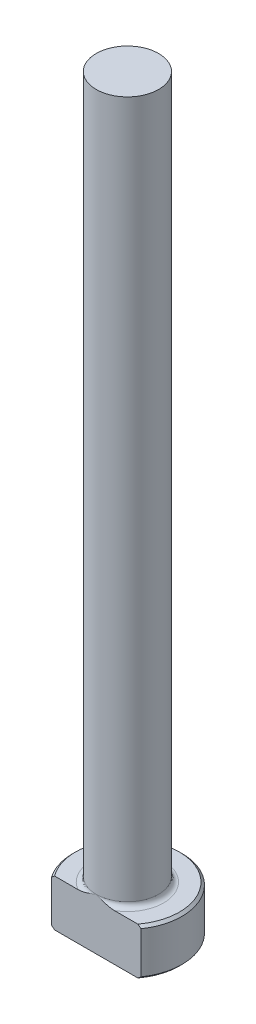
from build123d import *

# Parameters (mm, degrees)
CHAMFER1_SIZE = 0.254
FILLET1_R     = 0.508
KEY_DEPTH     = 77.603151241


with BuildPart() as part:
    # Sketch1 → Revolve1 (revolve)
    with BuildSketch(Plane.XY, mode=Mode.PRIVATE) as revolve1_sk:
        Polygon((0, 0), (-5.5499, 0), (-5.5499, 4.7498), (-3.175, 4.7498), (-3.175, 76.2), (0, 76.2), align=None)
    revolve(revolve1_sk.sketch.rotate(Axis((0, 259.958771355, 0), (0, -1, 0)), 270), axis=Axis((0, 259.958771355, 0), (0, -1, 0)))

    # Chamfer1
    chamfer1_edges = [part.edges().sort_by_distance(p)[0] for p in [
        (0, 4.7498, -5.5499),
        (0, 0, -5.5499),
    ]]
    chamfer(chamfer1_edges, length=CHAMFER1_SIZE)

    # Fillet1
    fillet1_edges = [part.edges().sort_by_distance(p)[0] for p in [
        (0, 4.7498, -3.175),
    ]]
    fillet(fillet1_edges, radius=FILLET1_R)

    # Sketch2 → Key (cut, through all)
    with BuildSketch(Plane(origin=(0, 0, 0), x_dir=(1, 0, 0), z_dir=(0, 1, 0))):
        with BuildLine():
            Line((-4.552006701, -3.175), (4.552006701, -3.175))
            ThreePointArc((4.552006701, -3.175), (0, -5.5499), (-4.552006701, -3.175))
        make_face()
    extrude(amount=KEY_DEPTH, mode=Mode.SUBTRACT)


solid = part.part
